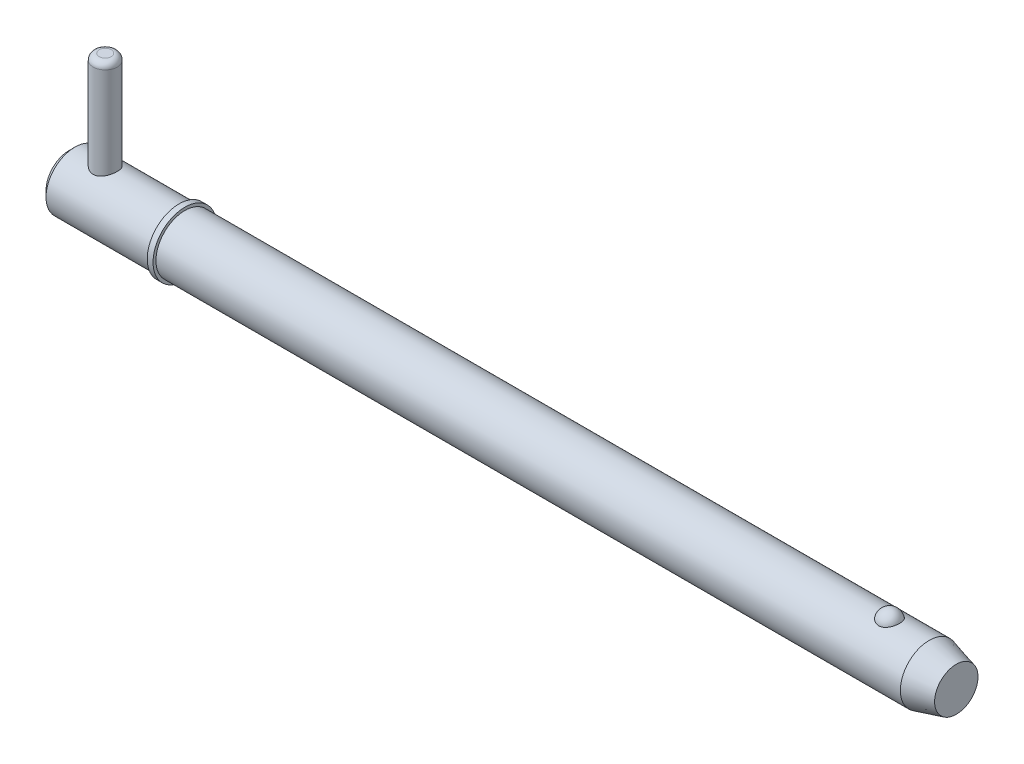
ISO-10303-21;
HEADER;
FILE_DESCRIPTION(('STEP AP214'),'2;1');
FILE_NAME('part.step','',(''),(''),'','','');
FILE_SCHEMA(('AUTOMOTIVE_DESIGN { 1 0 10303 214 1 1 1 1 }'));
ENDSEC;
DATA;
#1=APPLICATION_CONTEXT('core data for automotive mechanical design processes');
#2=APPLICATION_PROTOCOL_DEFINITION('international standard','automotive_design',2000,#1);
#3=PRODUCT_CONTEXT('',#1,'mechanical');
#4=PRODUCT('Part','Part','',(#3));
#5=PRODUCT_RELATED_PRODUCT_CATEGORY('part','',(#4));
#6=PRODUCT_DEFINITION_FORMATION('','',#4);
#7=PRODUCT_DEFINITION_CONTEXT('part definition',#1,'design');
#8=PRODUCT_DEFINITION('design','',#6,#7);
#9=PRODUCT_DEFINITION_SHAPE('','',#8);
#10=(LENGTH_UNIT() NAMED_UNIT(*) SI_UNIT(.MILLI.,.METRE.));
#11=(NAMED_UNIT(*) PLANE_ANGLE_UNIT() SI_UNIT($,.RADIAN.));
#12=(NAMED_UNIT(*) SI_UNIT($,.STERADIAN.) SOLID_ANGLE_UNIT());
#13=UNCERTAINTY_MEASURE_WITH_UNIT(LENGTH_MEASURE(1.E-05),#10,'distance_accuracy_value','');
#14=(GEOMETRIC_REPRESENTATION_CONTEXT(3) GLOBAL_UNCERTAINTY_ASSIGNED_CONTEXT((#13)) GLOBAL_UNIT_ASSIGNED_CONTEXT((#10,
#11,#12)) REPRESENTATION_CONTEXT('',''));
#15=CARTESIAN_POINT('',(0.,0.,0.));
#16=DIRECTION('',(0.,0.,1.));
#17=DIRECTION('',(1.,0.,0.));
#18=AXIS2_PLACEMENT_3D('',#15,#16,#17);
#19=CARTESIAN_POINT('',(5.94,20.635,0.));
#20=DIRECTION('',(0.,-1.,0.));
#21=DIRECTION('',(0.,0.,-1.));
#22=AXIS2_PLACEMENT_3D('',#19,#20,#21);
#23=CYLINDRICAL_SURFACE('',#22,1.98);
#24=CARTESIAN_POINT('',(5.94,-3.775,0.));
#25=DIRECTION('',(0.,1.,0.));
#26=DIRECTION('',(0.,0.,1.));
#27=AXIS2_PLACEMENT_3D('',#24,#25,#26);
#28=CIRCLE('',#27,1.98);
#29=CARTESIAN_POINT('',(5.94,-3.775,1.98));
#30=VERTEX_POINT('',#29);
#31=EDGE_CURVE('P0_E25',#30,#30,#28,.T.);
#32=ORIENTED_EDGE('',*,*,#31,.T.);
#33=EDGE_LOOP('',(#32));
#34=FACE_BOUND('',#33,.T.);
#35=CARTESIAN_POINT('',(5.94,19.645,0.));
#36=DIRECTION('',(0.,1.,0.));
#37=DIRECTION('',(0.,0.,1.));
#38=AXIS2_PLACEMENT_3D('',#35,#36,#37);
#39=CIRCLE('',#38,1.98);
#40=CARTESIAN_POINT('',(5.94,19.645,1.98));
#41=VERTEX_POINT('',#40);
#42=EDGE_CURVE('P0_E29',#41,#41,#39,.F.);
#43=ORIENTED_EDGE('',*,*,#42,.T.);
#44=EDGE_LOOP('',(#43));
#45=FACE_BOUND('',#44,.T.);
#46=ADVANCED_FACE('P0_F14',(#34,#45),#23,.T.);
#47=CARTESIAN_POINT('',(5.94,20.635,0.));
#48=DIRECTION('',(0.,1.,0.));
#49=DIRECTION('',(0.,0.,1.));
#50=AXIS2_PLACEMENT_3D('',#47,#48,#49);
#51=PLANE('',#50);
#52=CARTESIAN_POINT('',(5.94,20.635,0.));
#53=DIRECTION('',(0.,1.,0.));
#54=DIRECTION('',(0.,0.,1.));
#55=AXIS2_PLACEMENT_3D('',#52,#53,#54);
#56=CIRCLE('',#55,0.99);
#57=CARTESIAN_POINT('',(5.94,20.635,0.99));
#58=VERTEX_POINT('',#57);
#59=EDGE_CURVE('P0_E10',#58,#58,#56,.T.);
#60=ORIENTED_EDGE('',*,*,#59,.T.);
#61=EDGE_LOOP('',(#60));
#62=FACE_BOUND('',#61,.T.);
#63=ADVANCED_FACE('P0_F46',(#62),#51,.T.);
#64=CARTESIAN_POINT('',(5.94,-4.765,0.));
#65=DIRECTION('',(0.,1.,0.));
#66=DIRECTION('',(0.,0.,1.));
#67=AXIS2_PLACEMENT_3D('',#64,#65,#66);
#68=PLANE('',#67);
#69=CARTESIAN_POINT('',(5.94,-4.765,0.));
#70=DIRECTION('',(0.,1.,0.));
#71=DIRECTION('',(0.,0.,1.));
#72=AXIS2_PLACEMENT_3D('',#69,#70,#71);
#73=CIRCLE('',#72,0.99);
#74=CARTESIAN_POINT('',(5.94,-4.765,0.99));
#75=VERTEX_POINT('',#74);
#76=EDGE_CURVE('P0_E21',#75,#75,#73,.F.);
#77=ORIENTED_EDGE('',*,*,#76,.T.);
#78=EDGE_LOOP('',(#77));
#79=FACE_BOUND('',#78,.T.);
#80=ADVANCED_FACE('P0_F43',(#79),#68,.F.);
#81=CARTESIAN_POINT('',(5.94,-3.775,0.));
#82=DIRECTION('',(0.,1.,0.));
#83=DIRECTION('',(0.,0.,1.));
#84=AXIS2_PLACEMENT_3D('',#81,#82,#83);
#85=DEGENERATE_TOROIDAL_SURFACE('',#84,0.99,0.99,.T.);
#86=ORIENTED_EDGE('',*,*,#76,.F.);
#87=EDGE_LOOP('',(#86));
#88=FACE_BOUND('',#87,.T.);
#89=ORIENTED_EDGE('',*,*,#31,.F.);
#90=EDGE_LOOP('',(#89));
#91=FACE_BOUND('',#90,.T.);
#92=ADVANCED_FACE('P0_F38',(#88,#91),#85,.T.);
#93=CARTESIAN_POINT('',(5.94,19.645,0.));
#94=DIRECTION('',(0.,1.,0.));
#95=DIRECTION('',(0.,0.,1.));
#96=AXIS2_PLACEMENT_3D('',#93,#94,#95);
#97=DEGENERATE_TOROIDAL_SURFACE('',#96,0.99,0.99,.T.);
#98=ORIENTED_EDGE('',*,*,#42,.F.);
#99=EDGE_LOOP('',(#98));
#100=FACE_BOUND('',#99,.T.);
#101=ORIENTED_EDGE('',*,*,#59,.F.);
#102=EDGE_LOOP('',(#101));
#103=FACE_BOUND('',#102,.T.);
#104=ADVANCED_FACE('P0_F16',(#100,#103),#97,.T.);
#105=CLOSED_SHELL('',(#46,#63,#80,#92,#104));
#106=MANIFOLD_SOLID_BREP('P0_B1',#105);
#107=CARTESIAN_POINT('',(0.,0.,0.));
#108=DIRECTION('',(1.,0.,0.));
#109=DIRECTION('',(0.,0.,-1.));
#110=AXIS2_PLACEMENT_3D('',#107,#108,#109);
#111=CYLINDRICAL_SURFACE('',#110,4.765);
#112=CARTESIAN_POINT('',(141.604194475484,0.,0.));
#113=DIRECTION('',(1.,0.,0.));
#114=DIRECTION('',(0.,0.,-1.));
#115=AXIS2_PLACEMENT_3D('',#112,#113,#114);
#116=CIRCLE('',#115,4.765);
#117=CARTESIAN_POINT('',(141.604194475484,0.,-4.765));
#118=VERTEX_POINT('',#117);
#119=EDGE_CURVE('P1_E81',#118,#118,#116,.T.);
#120=ORIENTED_EDGE('',*,*,#119,.F.);
#121=EDGE_LOOP('',(#120));
#122=FACE_BOUND('',#121,.T.);
#123=CARTESIAN_POINT('',(19.05,0.,0.));
#124=DIRECTION('',(1.,0.,0.));
#125=DIRECTION('',(0.,0.,-1.));
#126=AXIS2_PLACEMENT_3D('',#123,#124,#125);
#127=CIRCLE('',#126,4.765);
#128=CARTESIAN_POINT('',(19.05,0.,-4.765));
#129=VERTEX_POINT('',#128);
#130=EDGE_CURVE('P1_E85',#129,#129,#127,.T.);
#131=ORIENTED_EDGE('',*,*,#130,.T.);
#132=EDGE_LOOP('',(#131));
#133=FACE_BOUND('',#132,.T.);
#134=CARTESIAN_POINT('',(135.051020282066,4.42764777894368,1.76101111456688));
#135=CARTESIAN_POINT('',(134.959721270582,4.42764470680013,1.76101422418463));
#136=CARTESIAN_POINT('',(134.868446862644,4.43059091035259,1.75366340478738));
#137=CARTESIAN_POINT('',(134.688615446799,4.44201846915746,1.72451180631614));
#138=CARTESIAN_POINT('',(134.600057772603,4.45049845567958,1.70271460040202));
#139=CARTESIAN_POINT('',(134.428257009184,4.47200516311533,1.64539370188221));
#140=CARTESIAN_POINT('',(134.345006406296,4.48502527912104,1.60988994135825));
#141=CARTESIAN_POINT('',(134.185763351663,4.51419542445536,1.52617873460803));
#142=CARTESIAN_POINT('',(134.109772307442,4.53034605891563,1.47796883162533));
#143=CARTESIAN_POINT('',(133.964744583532,4.56459317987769,1.36860494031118));
#144=CARTESIAN_POINT('',(133.895964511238,4.58273170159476,1.30712420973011));
#145=CARTESIAN_POINT('',(133.769342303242,4.61870302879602,1.17370204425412));
#146=CARTESIAN_POINT('',(133.711502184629,4.63653577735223,1.10175868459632));
#147=CARTESIAN_POINT('',(133.605570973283,4.67090140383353,0.945806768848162));
#148=CARTESIAN_POINT('',(133.558030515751,4.68734068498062,0.861402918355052));
#149=CARTESIAN_POINT('',(133.477081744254,4.71628466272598,0.685442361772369));
#150=CARTESIAN_POINT('',(133.443674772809,4.72878898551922,0.593884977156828));
#151=CARTESIAN_POINT('',(133.391287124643,4.74874061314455,0.404781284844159));
#152=CARTESIAN_POINT('',(133.372517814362,4.75611366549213,0.307168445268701));
#153=CARTESIAN_POINT('',(133.350584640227,4.76475393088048,0.109940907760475));
#154=CARTESIAN_POINT('',(133.347420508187,4.76602124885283,0.0103262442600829));
#155=CARTESIAN_POINT('',(133.356740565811,4.76232928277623,-0.187629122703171));
#156=CARTESIAN_POINT('',(133.369158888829,4.7573962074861,-0.285973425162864));
#157=CARTESIAN_POINT('',(133.409280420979,4.74184975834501,-0.479027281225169));
#158=CARTESIAN_POINT('',(133.436983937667,4.7312362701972,-0.573736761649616));
#159=CARTESIAN_POINT('',(133.507158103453,4.70540026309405,-0.756973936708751));
#160=CARTESIAN_POINT('',(133.549646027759,4.69017235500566,-0.845494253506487));
#161=CARTESIAN_POINT('',(133.648520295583,4.6566986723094,-1.01378033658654));
#162=CARTESIAN_POINT('',(133.704907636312,4.63845268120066,-1.09354547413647));
#163=CARTESIAN_POINT('',(133.830552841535,4.60085438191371,-1.24228523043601));
#164=CARTESIAN_POINT('',(133.899843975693,4.58149930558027,-1.31123108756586));
#165=CARTESIAN_POINT('',(134.049606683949,4.54391653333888,-1.43607409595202));
#166=CARTESIAN_POINT('',(134.130077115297,4.52568872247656,-1.49197257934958));
#167=CARTESIAN_POINT('',(134.298150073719,4.49293007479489,-1.58786764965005));
#168=CARTESIAN_POINT('',(134.385544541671,4.47832346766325,-1.62820219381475));
#169=CARTESIAN_POINT('',(134.566553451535,4.45406011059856,-1.69345757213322));
#170=CARTESIAN_POINT('',(134.66016555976,4.44440151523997,-1.71838415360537));
#171=CARTESIAN_POINT('',(134.845893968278,4.43159888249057,-1.75112843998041));
#172=CARTESIAN_POINT('',(134.937849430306,4.42815213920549,-1.75974223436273));
#173=CARTESIAN_POINT('',(135.121965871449,4.427247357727,-1.76201865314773));
#174=CARTESIAN_POINT('',(135.214126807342,4.42978816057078,-1.7556841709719));
#175=CARTESIAN_POINT('',(135.393129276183,4.44038648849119,-1.72869560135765));
#176=CARTESIAN_POINT('',(135.480047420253,4.44827555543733,-1.70847853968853));
#177=CARTESIAN_POINT('',(135.649131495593,4.46852246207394,-1.65479562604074));
#178=CARTESIAN_POINT('',(135.731297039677,4.48088066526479,-1.62132869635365));
#179=CARTESIAN_POINT('',(135.890591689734,4.50907357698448,-1.54120560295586));
#180=CARTESIAN_POINT('',(135.967570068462,4.52497884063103,-1.49427526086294));
#181=CARTESIAN_POINT('',(136.112708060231,4.55845148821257,-1.38881222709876));
#182=CARTESIAN_POINT('',(136.180865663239,4.57601924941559,-1.33027689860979));
#183=CARTESIAN_POINT('',(136.310099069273,4.61196537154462,-1.1999104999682));
#184=CARTESIAN_POINT('',(136.370656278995,4.63034074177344,-1.12756415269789));
#185=CARTESIAN_POINT('',(136.479279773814,4.66513959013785,-0.97361299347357));
#186=CARTESIAN_POINT('',(136.527343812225,4.68156271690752,-0.892006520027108));
#187=CARTESIAN_POINT('',(136.611383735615,4.71130224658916,-0.718892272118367));
#188=CARTESIAN_POINT('',(136.646918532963,4.724501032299,-0.627149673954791));
#189=CARTESIAN_POINT('',(136.702952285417,4.74571823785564,-0.438611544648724));
#190=CARTESIAN_POINT('',(136.723450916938,4.75373654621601,-0.34181590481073));
#191=CARTESIAN_POINT('',(136.749033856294,4.76378905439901,-0.14563306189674));
#192=CARTESIAN_POINT('',(136.754076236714,4.76580697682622,-0.0462395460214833));
#193=CARTESIAN_POINT('',(136.748523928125,4.7636057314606,0.152038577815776));
#194=CARTESIAN_POINT('',(136.737929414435,4.75938663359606,0.250923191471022));
#195=CARTESIAN_POINT('',(136.701387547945,4.74516937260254,0.445004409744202));
#196=CARTESIAN_POINT('',(136.675496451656,4.73519238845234,0.540213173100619));
#197=CARTESIAN_POINT('',(136.608927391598,4.71049394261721,0.724662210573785));
#198=CARTESIAN_POINT('',(136.568248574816,4.69577220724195,0.813902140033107));
#199=CARTESIAN_POINT('',(136.472717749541,4.66303767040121,0.984313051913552));
#200=CARTESIAN_POINT('',(136.417804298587,4.64501070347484,1.06544688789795));
#201=CARTESIAN_POINT('',(136.295049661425,4.60764678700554,1.21692673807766));
#202=CARTESIAN_POINT('',(136.227208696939,4.58830985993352,1.28727293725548));
#203=CARTESIAN_POINT('',(136.080548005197,4.55060370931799,1.41479271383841));
#204=CARTESIAN_POINT('',(136.001791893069,4.53222967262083,1.47203785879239));
#205=CARTESIAN_POINT('',(135.834989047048,4.49849576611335,1.57212016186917));
#206=CARTESIAN_POINT('',(135.746941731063,4.48313608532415,1.6149564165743));
#207=CARTESIAN_POINT('',(135.559791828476,4.45676184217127,1.68642657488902));
#208=CARTESIAN_POINT('',(135.460365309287,4.44598302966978,1.71430590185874));
#209=CARTESIAN_POINT('',(135.257621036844,4.43142918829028,1.7515925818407));
#210=CARTESIAN_POINT('',(135.154304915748,4.42765125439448,1.76100759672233));
#211=CARTESIAN_POINT('',(135.051020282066,4.42764777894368,1.76101111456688));
#212=B_SPLINE_CURVE_WITH_KNOTS('',3,(#134,#135,#136,#137,#138,#139,#140,#141,#142,#143,#144,
#145,#146,#147,#148,#149,#150,#151,#152,#153,#154,#155,#156,#157,#158,#159,#160,#161,#162,#163,
#164,#165,#166,#167,#168,#169,#170,#171,#172,#173,#174,#175,#176,#177,#178,#179,#180,#181,#182,
#183,#184,#185,#186,#187,#188,#189,#190,#191,#192,#193,#194,#195,#196,#197,#198,#199,#200,#201,
#202,#203,#204,#205,#206,#207,#208,#209,#210,#211),.UNSPECIFIED.,.T.,.F.,(4,2,2,2,2,2,2,2,2,2,2,
2,2,2,2,2,2,2,2,2,2,2,2,2,2,2,2,2,2,2,2,2,2,2,2,2,2,2,4),(0.,0.273517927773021,
0.546968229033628,0.820022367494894,1.09312934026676,1.37393946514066,1.6548013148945,
1.94820420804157,2.24163496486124,2.53922817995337,2.83681628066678,3.13315071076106,
3.42949110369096,3.72617893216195,4.02288805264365,4.32037303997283,4.61782764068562,
4.90840095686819,5.19886582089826,5.47474855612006,5.75057789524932,6.0180997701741,
6.28564340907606,6.55907787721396,6.83257454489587,7.11962987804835,7.40673679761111,
7.70312663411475,7.9995228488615,8.29672237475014,8.59391856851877,8.89002850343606,
9.18615552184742,9.48358266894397,9.7810047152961,10.0767610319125,10.3725358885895,
10.6820893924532,10.991514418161),.UNSPECIFIED.);
#213=CARTESIAN_POINT('',(135.051020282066,4.42764777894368,1.76101111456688));
#214=VERTEX_POINT('',#213);
#215=EDGE_CURVE('P1_E35',#214,#214,#212,.T.);
#216=ORIENTED_EDGE('',*,*,#215,.T.);
#217=EDGE_LOOP('',(#216));
#218=FACE_BOUND('',#217,.T.);
#219=ADVANCED_FACE('P1_F13',(#122,#133,#218),#111,.T.);
#220=CARTESIAN_POINT('',(0.,0.,0.));
#221=DIRECTION('',(-1.,0.,0.));
#222=DIRECTION('',(0.,0.,1.));
#223=AXIS2_PLACEMENT_3D('',#220,#221,#222);
#224=PLANE('',#223);
#225=CARTESIAN_POINT('',(0.,0.,0.));
#226=DIRECTION('',(1.,0.,0.));
#227=DIRECTION('',(0.,0.,-1.));
#228=AXIS2_PLACEMENT_3D('',#225,#226,#227);
#229=CIRCLE('',#228,3.812);
#230=CARTESIAN_POINT('',(0.,0.,-3.812));
#231=VERTEX_POINT('',#230);
#232=EDGE_CURVE('P1_E9',#231,#231,#229,.T.);
#233=ORIENTED_EDGE('',*,*,#232,.F.);
#234=EDGE_LOOP('',(#233));
#235=FACE_BOUND('',#234,.T.);
#236=ADVANCED_FACE('P1_F15',(#235),#224,.T.);
#237=CARTESIAN_POINT('',(0.952999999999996,0.,0.));
#238=DIRECTION('',(1.,0.,0.));
#239=DIRECTION('',(0.,0.,-1.));
#240=AXIS2_PLACEMENT_3D('',#237,#238,#239);
#241=CONICAL_SURFACE('',#240,4.765,0.78539816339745);
#242=ORIENTED_EDGE('',*,*,#232,.T.);
#243=EDGE_LOOP('',(#242));
#244=FACE_BOUND('',#243,.T.);
#245=CARTESIAN_POINT('',(0.952999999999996,0.,0.));
#246=DIRECTION('',(1.,0.,0.));
#247=DIRECTION('',(0.,0.,-1.));
#248=AXIS2_PLACEMENT_3D('',#245,#246,#247);
#249=CIRCLE('',#248,4.765);
#250=CARTESIAN_POINT('',(0.952999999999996,0.,-4.765));
#251=VERTEX_POINT('',#250);
#252=EDGE_CURVE('P1_E26',#251,#251,#249,.T.);
#253=ORIENTED_EDGE('',*,*,#252,.F.);
#254=EDGE_LOOP('',(#253));
#255=FACE_BOUND('',#254,.T.);
#256=ADVANCED_FACE('P1_F77',(#244,#255),#241,.T.);
#257=CARTESIAN_POINT('',(0.,0.,0.));
#258=DIRECTION('',(1.,0.,0.));
#259=DIRECTION('',(0.,0.,-1.));
#260=AXIS2_PLACEMENT_3D('',#257,#258,#259);
#261=CYLINDRICAL_SURFACE('',#260,4.765);
#262=CARTESIAN_POINT('',(5.94,-4.33414639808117,1.98));
#263=CARTESIAN_POINT('',(5.83435484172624,-4.33415447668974,1.97999169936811));
#264=CARTESIAN_POINT('',(5.72854887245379,-4.33806396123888,1.97149330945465));
#265=CARTESIAN_POINT('',(5.51998191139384,-4.35319906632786,1.93783487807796));
#266=CARTESIAN_POINT('',(5.41723000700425,-4.3644446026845,1.91262947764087));
#267=CARTESIAN_POINT('',(5.21817294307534,-4.39274225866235,1.84670269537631));
#268=CARTESIAN_POINT('',(5.12184344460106,-4.40977076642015,1.80604432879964));
#269=CARTESIAN_POINT('',(4.93740039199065,-4.44768106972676,1.71055160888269));
#270=CARTESIAN_POINT('',(4.84928487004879,-4.46856193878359,1.65572066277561));
#271=CARTESIAN_POINT('',(4.67826533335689,-4.51326966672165,1.52981120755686));
#272=CARTESIAN_POINT('',(4.59593118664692,-4.53719608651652,1.45799365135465));
#273=CARTESIAN_POINT('',(4.44405452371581,-4.58448035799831,1.30170177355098));
#274=CARTESIAN_POINT('',(4.37451692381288,-4.60783798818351,1.21722260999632));
#275=CARTESIAN_POINT('',(4.24730683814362,-4.65256187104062,1.03353484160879));
#276=CARTESIAN_POINT('',(4.19027484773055,-4.67379892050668,0.933848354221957));
#277=CARTESIAN_POINT('',(4.0940363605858,-4.7106711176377,0.7252544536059));
#278=CARTESIAN_POINT('',(4.05482199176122,-4.72630873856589,0.61635113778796));
#279=CARTESIAN_POINT('',(3.99739515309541,-4.74951416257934,0.398397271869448));
#280=CARTESIAN_POINT('',(3.97820018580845,-4.7574579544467,0.289646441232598));
#281=CARTESIAN_POINT('',(3.95818309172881,-4.76574596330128,0.0701967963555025));
#282=CARTESIAN_POINT('',(3.95735355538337,-4.76609324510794,-0.0405012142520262));
#283=CARTESIAN_POINT('',(3.9735743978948,-4.75937098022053,-0.253561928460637));
#284=CARTESIAN_POINT('',(3.98954548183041,-4.75274912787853,-0.356023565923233));
#285=CARTESIAN_POINT('',(4.03706504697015,-4.73344665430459,-0.556659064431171));
#286=CARTESIAN_POINT('',(4.06861467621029,-4.72076558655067,-0.654832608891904));
#287=CARTESIAN_POINT('',(4.14677192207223,-4.69032846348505,-0.845904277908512));
#288=CARTESIAN_POINT('',(4.19360181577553,-4.67249797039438,-0.938699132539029));
#289=CARTESIAN_POINT('',(4.30077315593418,-4.63350852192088,-1.11535616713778));
#290=CARTESIAN_POINT('',(4.3611193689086,-4.61234839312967,-1.19921518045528));
#291=CARTESIAN_POINT('',(4.49853487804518,-4.56707259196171,-1.3618711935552));
#292=CARTESIAN_POINT('',(4.57648039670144,-4.5428537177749,-1.43990029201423));
#293=CARTESIAN_POINT('',(4.74440779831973,-4.49530722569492,-1.58211009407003));
#294=CARTESIAN_POINT('',(4.83439425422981,-4.47197995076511,-1.64628551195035));
#295=CARTESIAN_POINT('',(5.02755026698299,-4.42812342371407,-1.76092221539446));
#296=CARTESIAN_POINT('',(5.13105348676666,-4.40770990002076,-1.81086937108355));
#297=CARTESIAN_POINT('',(5.34607555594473,-4.37336901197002,-1.89231211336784));
#298=CARTESIAN_POINT('',(5.45758864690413,-4.3594370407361,-1.92382080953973));
#299=CARTESIAN_POINT('',(5.67777275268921,-4.34077746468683,-1.96554536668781));
#300=CARTESIAN_POINT('',(5.78616167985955,-4.33551319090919,-1.9770057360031));
#301=CARTESIAN_POINT('',(6.00341835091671,-4.33325118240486,-1.98196183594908));
#302=CARTESIAN_POINT('',(6.11228591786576,-4.33625061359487,-1.97546372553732));
#303=CARTESIAN_POINT('',(6.32012423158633,-4.34962383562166,-1.94582288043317));
#304=CARTESIAN_POINT('',(6.41928436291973,-4.35951709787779,-1.92376364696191));
#305=CARTESIAN_POINT('',(6.61241543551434,-4.38495043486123,-1.86506038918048));
#306=CARTESIAN_POINT('',(6.70638516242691,-4.40049182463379,-1.82841296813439));
#307=CARTESIAN_POINT('',(6.89090272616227,-4.43627016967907,-1.73985559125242));
#308=CARTESIAN_POINT('',(6.98113841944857,-4.45667771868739,-1.68736639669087));
#309=CARTESIAN_POINT('',(7.1519532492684,-4.49964530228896,-1.56919282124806));
#310=CARTESIAN_POINT('',(7.232528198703,-4.52220626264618,-1.50350275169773));
#311=CARTESIAN_POINT('',(7.38851617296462,-4.56914071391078,-1.35452895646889));
#312=CARTESIAN_POINT('',(7.46298462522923,-4.5935132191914,-1.27025197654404));
#313=CARTESIAN_POINT('',(7.59689029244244,-4.63962841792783,-1.08983181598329));
#314=CARTESIAN_POINT('',(7.65632644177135,-4.66137092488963,-0.993687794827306));
#315=CARTESIAN_POINT('',(7.75840361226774,-4.69991192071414,-0.791608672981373));
#316=CARTESIAN_POINT('',(7.80100481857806,-4.71669866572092,-0.685651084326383));
#317=CARTESIAN_POINT('',(7.86746997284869,-4.74331408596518,-0.467197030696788));
#318=CARTESIAN_POINT('',(7.8913450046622,-4.75314687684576,-0.354704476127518));
#319=CARTESIAN_POINT('',(7.91828971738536,-4.76427543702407,-0.134819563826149));
#320=CARTESIAN_POINT('',(7.92269147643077,-4.76611762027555,-0.027616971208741));
#321=CARTESIAN_POINT('',(7.91414154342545,-4.76256684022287,0.185959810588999));
#322=CARTESIAN_POINT('',(7.90119286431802,-4.75717513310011,0.292334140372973));
#323=CARTESIAN_POINT('',(7.85926572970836,-4.74004856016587,0.497383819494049));
#324=CARTESIAN_POINT('',(7.83086647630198,-4.72854322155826,0.596198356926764));
#325=CARTESIAN_POINT('',(7.75947503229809,-4.70045111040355,0.787624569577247));
#326=CARTESIAN_POINT('',(7.71648006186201,-4.68386336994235,0.880235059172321));
#327=CARTESIAN_POINT('',(7.6149456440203,-4.64628321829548,1.06122875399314));
#328=CARTESIAN_POINT('',(7.55579211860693,-4.62512577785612,1.14923242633));
#329=CARTESIAN_POINT('',(7.42451813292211,-4.58091700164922,1.31443888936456));
#330=CARTESIAN_POINT('',(7.35239289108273,-4.5578649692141,1.39163767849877));
#331=CARTESIAN_POINT('',(7.19146107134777,-4.51050832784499,1.53847013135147));
#332=CARTESIAN_POINT('',(7.10185635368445,-4.48622440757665,1.60723941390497));
#333=CARTESIAN_POINT('',(6.91164948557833,-4.44076541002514,1.72888900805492));
#334=CARTESIAN_POINT('',(6.81104124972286,-4.41959206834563,1.78176046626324));
#335=CARTESIAN_POINT('',(6.60181953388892,-4.38318936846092,1.86953227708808));
#336=CARTESIAN_POINT('',(6.49325511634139,-4.3679267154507,1.90453365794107));
#337=CARTESIAN_POINT('',(6.32681512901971,-4.35102038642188,1.94268459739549));
#338=CARTESIAN_POINT('',(6.27079191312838,-4.34638447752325,1.953006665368));
#339=CARTESIAN_POINT('',(6.15793999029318,-4.33925923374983,1.96879053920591));
#340=CARTESIAN_POINT('',(6.10111188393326,-4.33676837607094,1.97425579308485));
#341=CARTESIAN_POINT('',(6.00947316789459,-4.33456308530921,1.97908711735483));
#342=CARTESIAN_POINT('',(5.97474528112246,-4.33414374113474,1.98000272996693));
#343=CARTESIAN_POINT('',(5.94,-4.33414639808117,1.98));
#344=B_SPLINE_CURVE_WITH_KNOTS('',3,(#262,#263,#264,#265,#266,#267,#268,#269,#270,#271,#272,
#273,#274,#275,#276,#277,#278,#279,#280,#281,#282,#283,#284,#285,#286,#287,#288,#289,#290,#291,
#292,#293,#294,#295,#296,#297,#298,#299,#300,#301,#302,#303,#304,#305,#306,#307,#308,#309,#310,
#311,#312,#313,#314,#315,#316,#317,#318,#319,#320,#321,#322,#323,#324,#325,#326,#327,#328,#329,
#330,#331,#332,#333,#334,#335,#336,#337,#338,#339,#340,#341,#342,#343),.UNSPECIFIED.,.T.,.F.,(4,
2,2,2,2,2,2,2,2,2,2,2,2,2,2,2,2,2,2,2,2,2,2,2,2,2,2,2,2,2,2,2,2,2,2,2,2,2,2,2,4),(0.,
0.316814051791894,0.634491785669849,0.950887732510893,1.2672076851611,1.60127705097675,
1.93547449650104,2.28407463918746,2.63252061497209,2.96292077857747,3.29318763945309,
3.60346227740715,3.91375978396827,4.22878888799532,4.54392926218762,4.88117914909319,
5.21855748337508,5.56691259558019,5.91501972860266,6.24062939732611,6.56612741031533,
6.87094948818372,7.17584258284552,7.49361276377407,7.81152017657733,8.15513975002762,
8.4987836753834,8.8432355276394,9.18748334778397,9.50777781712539,9.8280166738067,
10.1370037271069,10.4460496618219,10.7690461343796,11.0921619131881,11.4371238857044,
11.7822776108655,12.1254577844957,12.2967183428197,12.4678572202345,12.5720531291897),.UNSPECIFIED.);
#345=CARTESIAN_POINT('',(5.94,-4.33414639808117,1.98));
#346=VERTEX_POINT('',#345);
#347=EDGE_CURVE('P1_E17',#346,#346,#344,.T.);
#348=ORIENTED_EDGE('',*,*,#347,.F.);
#349=EDGE_LOOP('',(#348));
#350=FACE_BOUND('',#349,.T.);
#351=CARTESIAN_POINT('',(5.94,4.33414639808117,1.98));
#352=CARTESIAN_POINT('',(6.04564515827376,4.33415447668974,1.97999169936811));
#353=CARTESIAN_POINT('',(6.15145112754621,4.33806396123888,1.97149330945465));
#354=CARTESIAN_POINT('',(6.36001808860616,4.35319906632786,1.93783487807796));
#355=CARTESIAN_POINT('',(6.46276999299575,4.3644446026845,1.91262947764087));
#356=CARTESIAN_POINT('',(6.66182705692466,4.39274225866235,1.84670269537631));
#357=CARTESIAN_POINT('',(6.75815655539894,4.40977076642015,1.80604432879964));
#358=CARTESIAN_POINT('',(6.94259960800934,4.44768106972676,1.71055160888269));
#359=CARTESIAN_POINT('',(7.03071512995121,4.46856193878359,1.65572066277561));
#360=CARTESIAN_POINT('',(7.20173466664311,4.51326966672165,1.52981120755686));
#361=CARTESIAN_POINT('',(7.28406881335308,4.53719608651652,1.45799365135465));
#362=CARTESIAN_POINT('',(7.43594547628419,4.58448035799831,1.30170177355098));
#363=CARTESIAN_POINT('',(7.50548307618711,4.60783798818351,1.21722260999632));
#364=CARTESIAN_POINT('',(7.63269316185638,4.65256187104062,1.03353484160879));
#365=CARTESIAN_POINT('',(7.68972515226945,4.67379892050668,0.933848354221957));
#366=CARTESIAN_POINT('',(7.7859636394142,4.7106711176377,0.7252544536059));
#367=CARTESIAN_POINT('',(7.82517800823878,4.72630873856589,0.61635113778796));
#368=CARTESIAN_POINT('',(7.88260484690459,4.74951416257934,0.398397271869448));
#369=CARTESIAN_POINT('',(7.90179981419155,4.7574579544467,0.289646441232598));
#370=CARTESIAN_POINT('',(7.92181690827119,4.76574596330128,0.0701967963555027));
#371=CARTESIAN_POINT('',(7.92264644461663,4.76609324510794,-0.040501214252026));
#372=CARTESIAN_POINT('',(7.9064256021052,4.75937098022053,-0.253561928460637));
#373=CARTESIAN_POINT('',(7.89045451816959,4.75274912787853,-0.356023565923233));
#374=CARTESIAN_POINT('',(7.84293495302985,4.73344665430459,-0.55665906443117));
#375=CARTESIAN_POINT('',(7.81138532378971,4.72076558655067,-0.654832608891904));
#376=CARTESIAN_POINT('',(7.73322807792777,4.69032846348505,-0.845904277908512));
#377=CARTESIAN_POINT('',(7.68639818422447,4.67249797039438,-0.938699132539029));
#378=CARTESIAN_POINT('',(7.57922684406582,4.63350852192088,-1.11535616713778));
#379=CARTESIAN_POINT('',(7.5188806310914,4.61234839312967,-1.19921518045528));
#380=CARTESIAN_POINT('',(7.38146512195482,4.56707259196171,-1.3618711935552));
#381=CARTESIAN_POINT('',(7.30351960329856,4.5428537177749,-1.43990029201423));
#382=CARTESIAN_POINT('',(7.13559220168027,4.49530722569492,-1.58211009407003));
#383=CARTESIAN_POINT('',(7.04560574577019,4.47197995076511,-1.64628551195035));
#384=CARTESIAN_POINT('',(6.85244973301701,4.42812342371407,-1.76092221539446));
#385=CARTESIAN_POINT('',(6.74894651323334,4.40770990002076,-1.81086937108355));
#386=CARTESIAN_POINT('',(6.53392444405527,4.37336901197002,-1.89231211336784));
#387=CARTESIAN_POINT('',(6.42241135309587,4.3594370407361,-1.92382080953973));
#388=CARTESIAN_POINT('',(6.20222724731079,4.34077746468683,-1.96554536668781));
#389=CARTESIAN_POINT('',(6.09383832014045,4.33551319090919,-1.9770057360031));
#390=CARTESIAN_POINT('',(5.87658164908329,4.33325118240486,-1.98196183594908));
#391=CARTESIAN_POINT('',(5.76771408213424,4.33625061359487,-1.97546372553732));
#392=CARTESIAN_POINT('',(5.55987576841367,4.34962383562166,-1.94582288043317));
#393=CARTESIAN_POINT('',(5.46071563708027,4.35951709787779,-1.92376364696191));
#394=CARTESIAN_POINT('',(5.26758456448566,4.38495043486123,-1.86506038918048));
#395=CARTESIAN_POINT('',(5.17361483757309,4.40049182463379,-1.82841296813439));
#396=CARTESIAN_POINT('',(4.98909727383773,4.43627016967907,-1.73985559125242));
#397=CARTESIAN_POINT('',(4.89886158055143,4.45667771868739,-1.68736639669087));
#398=CARTESIAN_POINT('',(4.72804675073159,4.49964530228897,-1.56919282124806));
#399=CARTESIAN_POINT('',(4.647471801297,4.52220626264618,-1.50350275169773));
#400=CARTESIAN_POINT('',(4.49148382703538,4.56914071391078,-1.35452895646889));
#401=CARTESIAN_POINT('',(4.41701537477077,4.5935132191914,-1.27025197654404));
#402=CARTESIAN_POINT('',(4.28310970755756,4.63962841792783,-1.08983181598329));
#403=CARTESIAN_POINT('',(4.22367355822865,4.66137092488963,-0.993687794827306));
#404=CARTESIAN_POINT('',(4.12159638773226,4.69991192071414,-0.791608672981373));
#405=CARTESIAN_POINT('',(4.07899518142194,4.71669866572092,-0.685651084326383));
#406=CARTESIAN_POINT('',(4.01253002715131,4.74331408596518,-0.467197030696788));
#407=CARTESIAN_POINT('',(3.98865499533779,4.75314687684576,-0.354704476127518));
#408=CARTESIAN_POINT('',(3.96171028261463,4.76427543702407,-0.134819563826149));
#409=CARTESIAN_POINT('',(3.95730852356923,4.76611762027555,-0.0276169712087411));
#410=CARTESIAN_POINT('',(3.96585845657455,4.76256684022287,0.185959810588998));
#411=CARTESIAN_POINT('',(3.97880713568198,4.75717513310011,0.292334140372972));
#412=CARTESIAN_POINT('',(4.02073427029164,4.74004856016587,0.497383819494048));
#413=CARTESIAN_POINT('',(4.04913352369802,4.72854322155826,0.596198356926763));
#414=CARTESIAN_POINT('',(4.12052496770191,4.70045111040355,0.787624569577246));
#415=CARTESIAN_POINT('',(4.16351993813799,4.68386336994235,0.880235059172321));
#416=CARTESIAN_POINT('',(4.2650543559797,4.64628321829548,1.06122875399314));
#417=CARTESIAN_POINT('',(4.32420788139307,4.62512577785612,1.14923242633));
#418=CARTESIAN_POINT('',(4.45548186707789,4.58091700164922,1.31443888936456));
#419=CARTESIAN_POINT('',(4.52760710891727,4.5578649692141,1.39163767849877));
#420=CARTESIAN_POINT('',(4.68853892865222,4.51050832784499,1.53847013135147));
#421=CARTESIAN_POINT('',(4.77814364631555,4.48622440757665,1.60723941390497));
#422=CARTESIAN_POINT('',(4.96835051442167,4.44076541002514,1.72888900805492));
#423=CARTESIAN_POINT('',(5.06895875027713,4.41959206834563,1.78176046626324));
#424=CARTESIAN_POINT('',(5.27818046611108,4.38318936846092,1.86953227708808));
#425=CARTESIAN_POINT('',(5.38674488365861,4.3679267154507,1.90453365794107));
#426=CARTESIAN_POINT('',(5.55318487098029,4.35102038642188,1.94268459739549));
#427=CARTESIAN_POINT('',(5.60920808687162,4.34638447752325,1.953006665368));
#428=CARTESIAN_POINT('',(5.72206000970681,4.33925923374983,1.96879053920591));
#429=CARTESIAN_POINT('',(5.77888811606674,4.33676837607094,1.97425579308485));
#430=CARTESIAN_POINT('',(5.87052683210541,4.33456308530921,1.97908711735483));
#431=CARTESIAN_POINT('',(5.90525471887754,4.33414374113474,1.98000272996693));
#432=CARTESIAN_POINT('',(5.94,4.33414639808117,1.98));
#433=B_SPLINE_CURVE_WITH_KNOTS('',3,(#351,#352,#353,#354,#355,#356,#357,#358,#359,#360,#361,
#362,#363,#364,#365,#366,#367,#368,#369,#370,#371,#372,#373,#374,#375,#376,#377,#378,#379,#380,
#381,#382,#383,#384,#385,#386,#387,#388,#389,#390,#391,#392,#393,#394,#395,#396,#397,#398,#399,
#400,#401,#402,#403,#404,#405,#406,#407,#408,#409,#410,#411,#412,#413,#414,#415,#416,#417,#418,
#419,#420,#421,#422,#423,#424,#425,#426,#427,#428,#429,#430,#431,#432),.UNSPECIFIED.,.T.,.F.,(4,
2,2,2,2,2,2,2,2,2,2,2,2,2,2,2,2,2,2,2,2,2,2,2,2,2,2,2,2,2,2,2,2,2,2,2,2,2,2,2,4),(0.,
0.316814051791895,0.634491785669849,0.950887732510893,1.2672076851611,1.60127705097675,
1.93547449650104,2.28407463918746,2.63252061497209,2.96292077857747,3.29318763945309,
3.60346227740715,3.91375978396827,4.22878888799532,4.54392926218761,4.88117914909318,
5.21855748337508,5.56691259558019,5.91501972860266,6.24062939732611,6.56612741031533,
6.87094948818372,7.17584258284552,7.49361276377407,7.81152017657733,8.15513975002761,
8.4987836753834,8.84323552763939,9.18748334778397,9.50777781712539,9.8280166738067,
10.1370037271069,10.4460496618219,10.7690461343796,11.0921619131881,11.4371238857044,
11.7822776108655,12.1254577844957,12.2967183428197,12.4678572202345,12.5720531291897),.UNSPECIFIED.);
#434=CARTESIAN_POINT('',(5.94,4.33414639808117,1.98));
#435=VERTEX_POINT('',#434);
#436=EDGE_CURVE('P1_E43',#435,#435,#433,.T.);
#437=ORIENTED_EDGE('',*,*,#436,.F.);
#438=EDGE_LOOP('',(#437));
#439=FACE_BOUND('',#438,.T.);
#440=ORIENTED_EDGE('',*,*,#252,.T.);
#441=EDGE_LOOP('',(#440));
#442=FACE_BOUND('',#441,.T.);
#443=CARTESIAN_POINT('',(18.097,0.,0.));
#444=DIRECTION('',(1.,0.,0.));
#445=DIRECTION('',(0.,0.,-1.));
#446=AXIS2_PLACEMENT_3D('',#443,#444,#445);
#447=CIRCLE('',#446,4.765);
#448=CARTESIAN_POINT('',(18.097,0.,-4.765));
#449=VERTEX_POINT('',#448);
#450=EDGE_CURVE('P1_E31',#449,#449,#447,.T.);
#451=ORIENTED_EDGE('',*,*,#450,.F.);
#452=EDGE_LOOP('',(#451));
#453=FACE_BOUND('',#452,.T.);
#454=ADVANCED_FACE('P1_F103',(#350,#439,#442,#453),#261,.T.);
#455=CARTESIAN_POINT('',(18.097,4.765,0.));
#456=DIRECTION('',(-1.,0.,0.));
#457=DIRECTION('',(0.,0.,1.));
#458=AXIS2_PLACEMENT_3D('',#455,#456,#457);
#459=PLANE('',#458);
#460=ORIENTED_EDGE('',*,*,#450,.T.);
#461=EDGE_LOOP('',(#460));
#462=FACE_BOUND('',#461,.T.);
#463=CARTESIAN_POINT('',(18.097,0.,0.));
#464=DIRECTION('',(1.,0.,0.));
#465=DIRECTION('',(0.,0.,-1.));
#466=AXIS2_PLACEMENT_3D('',#463,#464,#465);
#467=CIRCLE('',#466,5.2415);
#468=CARTESIAN_POINT('',(18.097,0.,-5.2415));
#469=VERTEX_POINT('',#468);
#470=EDGE_CURVE('P1_E91',#469,#469,#467,.T.);
#471=ORIENTED_EDGE('',*,*,#470,.F.);
#472=EDGE_LOOP('',(#471));
#473=FACE_BOUND('',#472,.T.);
#474=ADVANCED_FACE('P1_F100',(#462,#473),#459,.T.);
#475=CARTESIAN_POINT('',(0.,0.,0.));
#476=DIRECTION('',(1.,0.,0.));
#477=DIRECTION('',(0.,0.,-1.));
#478=AXIS2_PLACEMENT_3D('',#475,#476,#477);
#479=CYLINDRICAL_SURFACE('',#478,5.2415);
#480=ORIENTED_EDGE('',*,*,#470,.T.);
#481=EDGE_LOOP('',(#480));
#482=FACE_BOUND('',#481,.T.);
#483=CARTESIAN_POINT('',(19.05,0.,0.));
#484=DIRECTION('',(1.,0.,0.));
#485=DIRECTION('',(0.,0.,-1.));
#486=AXIS2_PLACEMENT_3D('',#483,#484,#485);
#487=CIRCLE('',#486,5.2415);
#488=CARTESIAN_POINT('',(19.05,0.,-5.2415));
#489=VERTEX_POINT('',#488);
#490=EDGE_CURVE('P1_E88',#489,#489,#487,.T.);
#491=ORIENTED_EDGE('',*,*,#490,.F.);
#492=EDGE_LOOP('',(#491));
#493=FACE_BOUND('',#492,.T.);
#494=ADVANCED_FACE('P1_F68',(#482,#493),#479,.T.);
#495=CARTESIAN_POINT('',(19.05,5.2415,0.));
#496=DIRECTION('',(1.,0.,0.));
#497=DIRECTION('',(0.,0.,-1.));
#498=AXIS2_PLACEMENT_3D('',#495,#496,#497);
#499=PLANE('',#498);
#500=ORIENTED_EDGE('',*,*,#490,.T.);
#501=EDGE_LOOP('',(#500));
#502=FACE_BOUND('',#501,.T.);
#503=ORIENTED_EDGE('',*,*,#130,.F.);
#504=EDGE_LOOP('',(#503));
#505=FACE_BOUND('',#504,.T.);
#506=ADVANCED_FACE('P1_F62',(#502,#505),#499,.T.);
#507=CARTESIAN_POINT('',(146.05,0.,0.));
#508=DIRECTION('',(-1.,0.,0.));
#509=DIRECTION('',(0.,0.,1.));
#510=AXIS2_PLACEMENT_3D('',#507,#508,#509);
#511=CONICAL_SURFACE('',#510,3.57375000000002,0.261799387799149);
#512=ORIENTED_EDGE('',*,*,#119,.T.);
#513=EDGE_LOOP('',(#512));
#514=FACE_BOUND('',#513,.T.);
#515=CARTESIAN_POINT('',(146.05,0.,0.));
#516=DIRECTION('',(1.,0.,0.));
#517=DIRECTION('',(0.,0.,-1.));
#518=AXIS2_PLACEMENT_3D('',#515,#516,#517);
#519=CIRCLE('',#518,3.57375000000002);
#520=CARTESIAN_POINT('',(146.05,0.,-3.57375000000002));
#521=VERTEX_POINT('',#520);
#522=EDGE_CURVE('P1_E42',#521,#521,#519,.T.);
#523=ORIENTED_EDGE('',*,*,#522,.F.);
#524=EDGE_LOOP('',(#523));
#525=FACE_BOUND('',#524,.T.);
#526=ADVANCED_FACE('P1_F59',(#514,#525),#511,.T.);
#527=CARTESIAN_POINT('',(146.05,3.57375000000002,0.));
#528=DIRECTION('',(1.,0.,0.));
#529=DIRECTION('',(0.,0.,-1.));
#530=AXIS2_PLACEMENT_3D('',#527,#528,#529);
#531=PLANE('',#530);
#532=ORIENTED_EDGE('',*,*,#522,.T.);
#533=EDGE_LOOP('',(#532));
#534=FACE_BOUND('',#533,.T.);
#535=ADVANCED_FACE('P1_F55',(#534),#531,.T.);
#536=CARTESIAN_POINT('',(135.051020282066,4.2885,0.));
#537=DIRECTION('',(-1.,0.,0.));
#538=DIRECTION('',(0.,1.,0.));
#539=AXIS2_PLACEMENT_3D('',#536,#537,#538);
#540=SPHERICAL_SURFACE('',#539,1.7665);
#541=ORIENTED_EDGE('',*,*,#215,.F.);
#542=EDGE_LOOP('',(#541));
#543=FACE_BOUND('',#542,.T.);
#544=ADVANCED_FACE('P1_F50',(#543),#540,.T.);
#545=CARTESIAN_POINT('',(5.94,-5.2415,0.));
#546=DIRECTION('',(0.,1.,0.));
#547=DIRECTION('',(0.,0.,1.));
#548=AXIS2_PLACEMENT_3D('',#545,#546,#547);
#549=CYLINDRICAL_SURFACE('',#548,1.98);
#550=ORIENTED_EDGE('',*,*,#347,.T.);
#551=EDGE_LOOP('',(#550));
#552=FACE_BOUND('',#551,.T.);
#553=ORIENTED_EDGE('',*,*,#436,.T.);
#554=EDGE_LOOP('',(#553));
#555=FACE_BOUND('',#554,.T.);
#556=ADVANCED_FACE('P1_F54',(#552,#555),#549,.F.);
#557=CLOSED_SHELL('',(#219,#236,#256,#454,#474,#494,#506,#526,#535,#544,#556));
#558=MANIFOLD_SOLID_BREP('P1_B1',#557);
#559=ADVANCED_BREP_SHAPE_REPRESENTATION('',(#18,#106,#558),#14);
#560=SHAPE_DEFINITION_REPRESENTATION(#9,#559);
ENDSEC;
END-ISO-10303-21;
